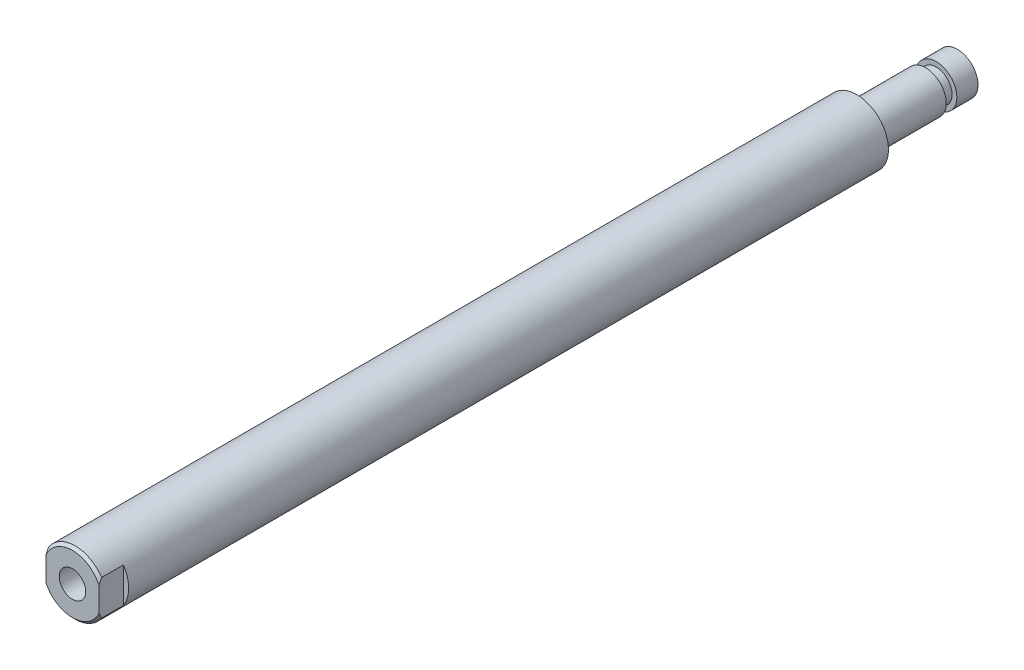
ISO-10303-21;
HEADER;
FILE_DESCRIPTION(('STEP AP214'),'2;1');
FILE_NAME('part.step','',(''),(''),'','','');
FILE_SCHEMA(('AUTOMOTIVE_DESIGN { 1 0 10303 214 1 1 1 1 }'));
ENDSEC;
DATA;
#1=APPLICATION_CONTEXT('core data for automotive mechanical design processes');
#2=APPLICATION_PROTOCOL_DEFINITION('international standard','automotive_design',2000,#1);
#3=PRODUCT_CONTEXT('',#1,'mechanical');
#4=PRODUCT('Part','Part','',(#3));
#5=PRODUCT_RELATED_PRODUCT_CATEGORY('part','',(#4));
#6=PRODUCT_DEFINITION_FORMATION('','',#4);
#7=PRODUCT_DEFINITION_CONTEXT('part definition',#1,'design');
#8=PRODUCT_DEFINITION('design','',#6,#7);
#9=PRODUCT_DEFINITION_SHAPE('','',#8);
#10=(LENGTH_UNIT() NAMED_UNIT(*) SI_UNIT(.MILLI.,.METRE.));
#11=(NAMED_UNIT(*) PLANE_ANGLE_UNIT() SI_UNIT($,.RADIAN.));
#12=(NAMED_UNIT(*) SI_UNIT($,.STERADIAN.) SOLID_ANGLE_UNIT());
#13=UNCERTAINTY_MEASURE_WITH_UNIT(LENGTH_MEASURE(1.E-05),#10,'distance_accuracy_value','');
#14=(GEOMETRIC_REPRESENTATION_CONTEXT(3) GLOBAL_UNCERTAINTY_ASSIGNED_CONTEXT((#13)) GLOBAL_UNIT_ASSIGNED_CONTEXT((#10,
#11,#12)) REPRESENTATION_CONTEXT('',''));
#15=CARTESIAN_POINT('',(0.,0.,0.));
#16=DIRECTION('',(0.,0.,1.));
#17=DIRECTION('',(1.,0.,0.));
#18=AXIS2_PLACEMENT_3D('',#15,#16,#17);
#19=CARTESIAN_POINT('',(0.,3.90000000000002,-167.));
#20=DIRECTION('',(0.,0.,-1.));
#21=DIRECTION('',(-1.,0.,0.));
#22=AXIS2_PLACEMENT_3D('',#19,#20,#21);
#23=PLANE('',#22);
#24=CARTESIAN_POINT('',(0.,0.,-167.));
#25=DIRECTION('',(0.,0.,-1.));
#26=DIRECTION('',(-1.,0.,0.));
#27=AXIS2_PLACEMENT_3D('',#24,#25,#26);
#28=CIRCLE('',#27,3.90000000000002);
#29=CARTESIAN_POINT('',(-3.90000000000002,0.,-167.));
#30=VERTEX_POINT('',#29);
#31=EDGE_CURVE('E141',#30,#30,#28,.T.);
#32=ORIENTED_EDGE('',*,*,#31,.T.);
#33=EDGE_LOOP('',(#32));
#34=FACE_BOUND('',#33,.T.);
#35=ADVANCED_FACE('F33',(#34),#23,.T.);
#36=CARTESIAN_POINT('',(0.,0.,0.));
#37=DIRECTION('',(0.,0.,-1.));
#38=DIRECTION('',(-1.,0.,0.));
#39=AXIS2_PLACEMENT_3D('',#36,#37,#38);
#40=CYLINDRICAL_SURFACE('',#39,3.90000000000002);
#41=CARTESIAN_POINT('',(0.,0.,-163.));
#42=DIRECTION('',(0.,0.,-1.));
#43=DIRECTION('',(-1.,0.,0.));
#44=AXIS2_PLACEMENT_3D('',#41,#42,#43);
#45=CIRCLE('',#44,3.90000000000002);
#46=CARTESIAN_POINT('',(-3.90000000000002,0.,-163.));
#47=VERTEX_POINT('',#46);
#48=EDGE_CURVE('E138',#47,#47,#45,.T.);
#49=ORIENTED_EDGE('',*,*,#48,.T.);
#50=EDGE_LOOP('',(#49));
#51=FACE_BOUND('',#50,.T.);
#52=ORIENTED_EDGE('',*,*,#31,.F.);
#53=EDGE_LOOP('',(#52));
#54=FACE_BOUND('',#53,.T.);
#55=ADVANCED_FACE('F215',(#51,#54),#40,.T.);
#56=CARTESIAN_POINT('',(0.,3.00000000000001,-163.));
#57=DIRECTION('',(0.,0.,1.));
#58=DIRECTION('',(1.,0.,0.));
#59=AXIS2_PLACEMENT_3D('',#56,#57,#58);
#60=PLANE('',#59);
#61=CARTESIAN_POINT('',(0.,0.,-163.));
#62=DIRECTION('',(0.,0.,-1.));
#63=DIRECTION('',(-1.,0.,0.));
#64=AXIS2_PLACEMENT_3D('',#61,#62,#63);
#65=CIRCLE('',#64,3.00000000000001);
#66=CARTESIAN_POINT('',(-3.00000000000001,0.,-163.));
#67=VERTEX_POINT('',#66);
#68=EDGE_CURVE('E135',#67,#67,#65,.T.);
#69=ORIENTED_EDGE('',*,*,#68,.T.);
#70=EDGE_LOOP('',(#69));
#71=FACE_BOUND('',#70,.T.);
#72=ORIENTED_EDGE('',*,*,#48,.F.);
#73=EDGE_LOOP('',(#72));
#74=FACE_BOUND('',#73,.T.);
#75=ADVANCED_FACE('F220',(#71,#74),#60,.T.);
#76=CARTESIAN_POINT('',(0.,0.,0.));
#77=DIRECTION('',(0.,0.,-1.));
#78=DIRECTION('',(-1.,0.,0.));
#79=AXIS2_PLACEMENT_3D('',#76,#77,#78);
#80=CYLINDRICAL_SURFACE('',#79,3.00000000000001);
#81=CARTESIAN_POINT('',(0.,0.,-161.));
#82=DIRECTION('',(0.,0.,-1.));
#83=DIRECTION('',(-1.,0.,0.));
#84=AXIS2_PLACEMENT_3D('',#81,#82,#83);
#85=CIRCLE('',#84,3.00000000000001);
#86=CARTESIAN_POINT('',(-3.00000000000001,0.,-161.));
#87=VERTEX_POINT('',#86);
#88=EDGE_CURVE('E132',#87,#87,#85,.T.);
#89=ORIENTED_EDGE('',*,*,#88,.T.);
#90=EDGE_LOOP('',(#89));
#91=FACE_BOUND('',#90,.T.);
#92=ORIENTED_EDGE('',*,*,#68,.F.);
#93=EDGE_LOOP('',(#92));
#94=FACE_BOUND('',#93,.T.);
#95=ADVANCED_FACE('F227',(#91,#94),#80,.T.);
#96=CARTESIAN_POINT('',(0.,3.00000000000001,-161.));
#97=DIRECTION('',(0.,0.,-1.));
#98=DIRECTION('',(-1.,0.,0.));
#99=AXIS2_PLACEMENT_3D('',#96,#97,#98);
#100=PLANE('',#99);
#101=CARTESIAN_POINT('',(0.,0.,-161.));
#102=DIRECTION('',(0.,0.,-1.));
#103=DIRECTION('',(-1.,0.,0.));
#104=AXIS2_PLACEMENT_3D('',#101,#102,#103);
#105=CIRCLE('',#104,3.90000000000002);
#106=CARTESIAN_POINT('',(-3.90000000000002,0.,-161.));
#107=VERTEX_POINT('',#106);
#108=EDGE_CURVE('E129',#107,#107,#105,.T.);
#109=ORIENTED_EDGE('',*,*,#108,.T.);
#110=EDGE_LOOP('',(#109));
#111=FACE_BOUND('',#110,.T.);
#112=ORIENTED_EDGE('',*,*,#88,.F.);
#113=EDGE_LOOP('',(#112));
#114=FACE_BOUND('',#113,.T.);
#115=ADVANCED_FACE('F233',(#111,#114),#100,.T.);
#116=CARTESIAN_POINT('',(0.,0.,0.));
#117=DIRECTION('',(0.,0.,-1.));
#118=DIRECTION('',(-1.,0.,0.));
#119=AXIS2_PLACEMENT_3D('',#116,#117,#118);
#120=CYLINDRICAL_SURFACE('',#119,3.90000000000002);
#121=CARTESIAN_POINT('',(0.,0.,-149.));
#122=DIRECTION('',(0.,0.,-1.));
#123=DIRECTION('',(-1.,0.,0.));
#124=AXIS2_PLACEMENT_3D('',#121,#122,#123);
#125=CIRCLE('',#124,3.90000000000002);
#126=CARTESIAN_POINT('',(-3.90000000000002,0.,-149.));
#127=VERTEX_POINT('',#126);
#128=EDGE_CURVE('E126',#127,#127,#125,.T.);
#129=ORIENTED_EDGE('',*,*,#128,.T.);
#130=EDGE_LOOP('',(#129));
#131=FACE_BOUND('',#130,.T.);
#132=ORIENTED_EDGE('',*,*,#108,.F.);
#133=EDGE_LOOP('',(#132));
#134=FACE_BOUND('',#133,.T.);
#135=ADVANCED_FACE('F237',(#131,#134),#120,.T.);
#136=CARTESIAN_POINT('',(0.,0.,-148.5));
#137=DIRECTION('',(0.,0.,-1.));
#138=DIRECTION('',(-1.,0.,0.));
#139=AXIS2_PLACEMENT_3D('',#136,#137,#138);
#140=TOROIDAL_SURFACE('',#139,3.90000000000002,0.5);
#141=CARTESIAN_POINT('',(0.,0.,-148.));
#142=DIRECTION('',(0.,0.,-1.));
#143=DIRECTION('',(-1.,0.,0.));
#144=AXIS2_PLACEMENT_3D('',#141,#142,#143);
#145=CIRCLE('',#144,3.90000000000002);
#146=CARTESIAN_POINT('',(-3.90000000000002,0.,-148.));
#147=VERTEX_POINT('',#146);
#148=EDGE_CURVE('E123',#147,#147,#145,.T.);
#149=ORIENTED_EDGE('',*,*,#148,.T.);
#150=EDGE_LOOP('',(#149));
#151=FACE_BOUND('',#150,.T.);
#152=ORIENTED_EDGE('',*,*,#128,.F.);
#153=EDGE_LOOP('',(#152));
#154=FACE_BOUND('',#153,.T.);
#155=ADVANCED_FACE('F241',(#151,#154),#140,.F.);
#156=CARTESIAN_POINT('',(0.,6.,-148.));
#157=DIRECTION('',(0.,0.,-1.));
#158=DIRECTION('',(-1.,0.,0.));
#159=AXIS2_PLACEMENT_3D('',#156,#157,#158);
#160=PLANE('',#159);
#161=CARTESIAN_POINT('',(0.,0.,-148.));
#162=DIRECTION('',(0.,0.,-1.));
#163=DIRECTION('',(-1.,0.,0.));
#164=AXIS2_PLACEMENT_3D('',#161,#162,#163);
#165=CIRCLE('',#164,6.);
#166=CARTESIAN_POINT('',(-6.,0.,-148.));
#167=VERTEX_POINT('',#166);
#168=EDGE_CURVE('E120',#167,#167,#165,.T.);
#169=ORIENTED_EDGE('',*,*,#168,.T.);
#170=EDGE_LOOP('',(#169));
#171=FACE_BOUND('',#170,.T.);
#172=ORIENTED_EDGE('',*,*,#148,.F.);
#173=EDGE_LOOP('',(#172));
#174=FACE_BOUND('',#173,.T.);
#175=ADVANCED_FACE('F245',(#171,#174),#160,.T.);
#176=CARTESIAN_POINT('',(0.,0.,0.));
#177=DIRECTION('',(0.,0.,-1.));
#178=DIRECTION('',(-1.,0.,0.));
#179=AXIS2_PLACEMENT_3D('',#176,#177,#178);
#180=CYLINDRICAL_SURFACE('',#179,6.);
#181=DIRECTION('',(0.,0.,-1.));
#182=VECTOR('',#181,1.);
#183=CARTESIAN_POINT('',(5.,-3.3166247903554,0.));
#184=LINE('',#183,#182);
#185=CARTESIAN_POINT('',(5.,-3.3166247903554,-0.500000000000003));
#186=VERTEX_POINT('',#185);
#187=CARTESIAN_POINT('',(5.,-3.3166247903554,-4.6));
#188=VERTEX_POINT('',#187);
#189=EDGE_CURVE('E116',#186,#188,#184,.T.);
#190=ORIENTED_EDGE('',*,*,#189,.F.);
#191=CARTESIAN_POINT('',(0.,0.,-0.500000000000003));
#192=DIRECTION('',(0.,0.,1.));
#193=DIRECTION('',(1.,0.,0.));
#194=AXIS2_PLACEMENT_3D('',#191,#192,#193);
#195=CIRCLE('',#194,6.);
#196=CARTESIAN_POINT('',(-5.,-3.3166247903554,-0.500000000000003));
#197=VERTEX_POINT('',#196);
#198=EDGE_CURVE('E156',#186,#197,#195,.F.);
#199=ORIENTED_EDGE('',*,*,#198,.T.);
#200=DIRECTION('',(0.,0.,-1.));
#201=VECTOR('',#200,1.);
#202=CARTESIAN_POINT('',(-5.,-3.3166247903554,0.));
#203=LINE('',#202,#201);
#204=CARTESIAN_POINT('',(-5.,-3.3166247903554,-4.6));
#205=VERTEX_POINT('',#204);
#206=EDGE_CURVE('E110',#205,#197,#203,.F.);
#207=ORIENTED_EDGE('',*,*,#206,.F.);
#208=CARTESIAN_POINT('',(0.,0.,-4.6));
#209=DIRECTION('',(0.,0.,-1.));
#210=DIRECTION('',(-1.,0.,0.));
#211=AXIS2_PLACEMENT_3D('',#208,#209,#210);
#212=CIRCLE('',#211,6.);
#213=CARTESIAN_POINT('',(-5.,3.3166247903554,-4.6));
#214=VERTEX_POINT('',#213);
#215=EDGE_CURVE('E151',#214,#205,#212,.F.);
#216=ORIENTED_EDGE('',*,*,#215,.F.);
#217=DIRECTION('',(0.,0.,-1.));
#218=VECTOR('',#217,1.);
#219=CARTESIAN_POINT('',(-5.,3.3166247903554,0.));
#220=LINE('',#219,#218);
#221=CARTESIAN_POINT('',(-5.,3.3166247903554,-0.500000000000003));
#222=VERTEX_POINT('',#221);
#223=EDGE_CURVE('E108',#222,#214,#220,.T.);
#224=ORIENTED_EDGE('',*,*,#223,.F.);
#225=CARTESIAN_POINT('',(0.,0.,-0.500000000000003));
#226=DIRECTION('',(0.,0.,1.));
#227=DIRECTION('',(1.,0.,0.));
#228=AXIS2_PLACEMENT_3D('',#225,#226,#227);
#229=CIRCLE('',#228,6.);
#230=CARTESIAN_POINT('',(5.,3.3166247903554,-0.500000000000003));
#231=VERTEX_POINT('',#230);
#232=EDGE_CURVE('E153',#222,#231,#229,.F.);
#233=ORIENTED_EDGE('',*,*,#232,.T.);
#234=DIRECTION('',(0.,0.,-1.));
#235=VECTOR('',#234,1.);
#236=CARTESIAN_POINT('',(5.,3.3166247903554,0.));
#237=LINE('',#236,#235);
#238=CARTESIAN_POINT('',(5.,3.3166247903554,-4.6));
#239=VERTEX_POINT('',#238);
#240=EDGE_CURVE('E118',#239,#231,#237,.F.);
#241=ORIENTED_EDGE('',*,*,#240,.F.);
#242=CARTESIAN_POINT('',(0.,0.,-4.6));
#243=DIRECTION('',(0.,0.,-1.));
#244=DIRECTION('',(-1.,0.,0.));
#245=AXIS2_PLACEMENT_3D('',#242,#243,#244);
#246=CIRCLE('',#245,6.);
#247=EDGE_CURVE('E146',#188,#239,#246,.F.);
#248=ORIENTED_EDGE('',*,*,#247,.F.);
#249=EDGE_LOOP('',(#190,#199,#207,#216,#224,#233,#241,#248));
#250=FACE_BOUND('',#249,.T.);
#251=ORIENTED_EDGE('',*,*,#168,.F.);
#252=EDGE_LOOP('',(#251));
#253=FACE_BOUND('',#252,.T.);
#254=ADVANCED_FACE('F204',(#250,#253),#180,.T.);
#255=CARTESIAN_POINT('',(0.,0.,0.));
#256=DIRECTION('',(0.,0.,1.));
#257=DIRECTION('',(1.,0.,0.));
#258=AXIS2_PLACEMENT_3D('',#255,#256,#257);
#259=PLANE('',#258);
#260=CARTESIAN_POINT('',(0.,0.,0.));
#261=DIRECTION('',(0.,0.,1.));
#262=DIRECTION('',(1.,0.,0.));
#263=AXIS2_PLACEMENT_3D('',#260,#261,#262);
#264=CIRCLE('',#263,2.49999999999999);
#265=CARTESIAN_POINT('',(2.49999999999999,0.,0.));
#266=VERTEX_POINT('',#265);
#267=EDGE_CURVE('E100',#266,#266,#264,.T.);
#268=ORIENTED_EDGE('',*,*,#267,.F.);
#269=EDGE_LOOP('',(#268));
#270=FACE_BOUND('',#269,.T.);
#271=DIRECTION('',(0.,1.,0.));
#272=VECTOR('',#271,1.);
#273=CARTESIAN_POINT('',(-5.,0.,0.));
#274=LINE('',#273,#272);
#275=CARTESIAN_POINT('',(-5.,-2.2912878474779,0.));
#276=VERTEX_POINT('',#275);
#277=CARTESIAN_POINT('',(-5.,2.2912878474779,0.));
#278=VERTEX_POINT('',#277);
#279=EDGE_CURVE('E148',#276,#278,#274,.T.);
#280=ORIENTED_EDGE('',*,*,#279,.F.);
#281=CARTESIAN_POINT('',(0.,0.,0.));
#282=DIRECTION('',(0.,0.,1.));
#283=DIRECTION('',(1.,0.,0.));
#284=AXIS2_PLACEMENT_3D('',#281,#282,#283);
#285=CIRCLE('',#284,5.49999999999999);
#286=CARTESIAN_POINT('',(5.,-2.2912878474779,0.));
#287=VERTEX_POINT('',#286);
#288=EDGE_CURVE('E52',#276,#287,#285,.T.);
#289=ORIENTED_EDGE('',*,*,#288,.T.);
#290=DIRECTION('',(0.,-1.,0.));
#291=VECTOR('',#290,1.);
#292=CARTESIAN_POINT('',(5.,0.,0.));
#293=LINE('',#292,#291);
#294=CARTESIAN_POINT('',(5.,2.2912878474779,0.));
#295=VERTEX_POINT('',#294);
#296=EDGE_CURVE('E144',#295,#287,#293,.T.);
#297=ORIENTED_EDGE('',*,*,#296,.F.);
#298=CARTESIAN_POINT('',(0.,0.,0.));
#299=DIRECTION('',(0.,0.,1.));
#300=DIRECTION('',(1.,0.,0.));
#301=AXIS2_PLACEMENT_3D('',#298,#299,#300);
#302=CIRCLE('',#301,5.49999999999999);
#303=EDGE_CURVE('E193',#295,#278,#302,.T.);
#304=ORIENTED_EDGE('',*,*,#303,.T.);
#305=EDGE_LOOP('',(#280,#289,#297,#304));
#306=FACE_BOUND('',#305,.T.);
#307=ADVANCED_FACE('F186',(#270,#306),#259,.T.);
#308=CARTESIAN_POINT('',(5.,-6.,0.));
#309=DIRECTION('',(-1.,0.,0.));
#310=DIRECTION('',(0.,0.,1.));
#311=AXIS2_PLACEMENT_3D('',#308,#309,#310);
#312=PLANE('',#311);
#313=ORIENTED_EDGE('',*,*,#296,.T.);
#314=CARTESIAN_POINT('',(5.,-2.2912878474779,0.));
#315=CARTESIAN_POINT('',(5.,-2.37912643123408,-0.0365976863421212));
#316=CARTESIAN_POINT('',(5.,-2.4663415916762,-0.074666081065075));
#317=CARTESIAN_POINT('',(5.,-2.6395087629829,-0.153410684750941));
#318=CARTESIAN_POINT('',(5.,-2.72546167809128,-0.194084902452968));
#319=CARTESIAN_POINT('',(5.,-2.8962115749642,-0.277759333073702));
#320=CARTESIAN_POINT('',(5.,-2.98100867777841,-0.320759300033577));
#321=CARTESIAN_POINT('',(5.,-3.1495829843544,-0.408867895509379));
#322=CARTESIAN_POINT('',(5.,-3.23335936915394,-0.453978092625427));
#323=CARTESIAN_POINT('',(5.,-3.3166247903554,-0.500000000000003));
#324=B_SPLINE_CURVE_WITH_KNOTS('',3,(#314,#315,#316,#317,#318,#319,#320,#321,#322,#323),
.UNSPECIFIED.,.F.,.F.,(4,2,2,2,4),(0.,0.285445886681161,0.5706761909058,0.85587638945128,
1.14129206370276),.UNSPECIFIED.);
#325=EDGE_CURVE('E11',#287,#186,#324,.T.);
#326=ORIENTED_EDGE('',*,*,#325,.T.);
#327=ORIENTED_EDGE('',*,*,#189,.T.);
#328=DIRECTION('',(0.,1.,0.));
#329=VECTOR('',#328,1.);
#330=CARTESIAN_POINT('',(5.,-6.,-4.6));
#331=LINE('',#330,#329);
#332=EDGE_CURVE('E113',#188,#239,#331,.T.);
#333=ORIENTED_EDGE('',*,*,#332,.T.);
#334=ORIENTED_EDGE('',*,*,#240,.T.);
#335=CARTESIAN_POINT('',(5.,3.3166247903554,-0.500000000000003));
#336=CARTESIAN_POINT('',(5.,3.23335936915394,-0.453978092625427));
#337=CARTESIAN_POINT('',(5.,3.1495829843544,-0.408867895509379));
#338=CARTESIAN_POINT('',(5.,2.98100867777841,-0.320759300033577));
#339=CARTESIAN_POINT('',(5.,2.8962115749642,-0.277759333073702));
#340=CARTESIAN_POINT('',(5.,2.72546167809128,-0.194084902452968));
#341=CARTESIAN_POINT('',(5.,2.6395087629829,-0.153410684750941));
#342=CARTESIAN_POINT('',(5.,2.4663415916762,-0.0746660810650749));
#343=CARTESIAN_POINT('',(5.,2.37912643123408,-0.0365976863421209));
#344=CARTESIAN_POINT('',(5.,2.2912878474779,0.));
#345=B_SPLINE_CURVE_WITH_KNOTS('',3,(#335,#336,#337,#338,#339,#340,#341,#342,#343,#344),
.UNSPECIFIED.,.F.,.F.,(4,2,2,2,4),(0.,0.285415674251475,0.570615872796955,0.855846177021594,
1.14129206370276),.UNSPECIFIED.);
#346=EDGE_CURVE('E45',#231,#295,#345,.T.);
#347=ORIENTED_EDGE('',*,*,#346,.T.);
#348=EDGE_LOOP('',(#313,#326,#327,#333,#334,#347));
#349=FACE_BOUND('',#348,.T.);
#350=ADVANCED_FACE('F180',(#349),#312,.F.);
#351=CARTESIAN_POINT('',(6.,-6.,-4.6));
#352=DIRECTION('',(0.,0.,-1.));
#353=DIRECTION('',(-1.,0.,0.));
#354=AXIS2_PLACEMENT_3D('',#351,#352,#353);
#355=PLANE('',#354);
#356=ORIENTED_EDGE('',*,*,#332,.F.);
#357=ORIENTED_EDGE('',*,*,#247,.T.);
#358=EDGE_LOOP('',(#356,#357));
#359=FACE_BOUND('',#358,.T.);
#360=ADVANCED_FACE('F185',(#359),#355,.F.);
#361=CARTESIAN_POINT('',(-6.,-6.,-4.6));
#362=DIRECTION('',(0.,0.,-1.));
#363=DIRECTION('',(-1.,0.,0.));
#364=AXIS2_PLACEMENT_3D('',#361,#362,#363);
#365=PLANE('',#364);
#366=ORIENTED_EDGE('',*,*,#215,.T.);
#367=DIRECTION('',(0.,1.,0.));
#368=VECTOR('',#367,1.);
#369=CARTESIAN_POINT('',(-5.,-6.,-4.6));
#370=LINE('',#369,#368);
#371=EDGE_CURVE('E103',#205,#214,#370,.T.);
#372=ORIENTED_EDGE('',*,*,#371,.T.);
#373=EDGE_LOOP('',(#366,#372));
#374=FACE_BOUND('',#373,.T.);
#375=ADVANCED_FACE('F177',(#374),#365,.F.);
#376=CARTESIAN_POINT('',(-5.,-6.,0.));
#377=DIRECTION('',(1.,0.,0.));
#378=DIRECTION('',(0.,0.,-1.));
#379=AXIS2_PLACEMENT_3D('',#376,#377,#378);
#380=PLANE('',#379);
#381=ORIENTED_EDGE('',*,*,#206,.T.);
#382=CARTESIAN_POINT('',(-5.,-3.3166247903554,-0.500000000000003));
#383=CARTESIAN_POINT('',(-5.,-3.23335936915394,-0.453978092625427));
#384=CARTESIAN_POINT('',(-5.,-3.1495829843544,-0.40886789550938));
#385=CARTESIAN_POINT('',(-5.,-2.98100867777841,-0.320759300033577));
#386=CARTESIAN_POINT('',(-5.,-2.8962115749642,-0.277759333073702));
#387=CARTESIAN_POINT('',(-5.,-2.72546167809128,-0.194084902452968));
#388=CARTESIAN_POINT('',(-5.,-2.6395087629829,-0.153410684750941));
#389=CARTESIAN_POINT('',(-5.,-2.4663415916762,-0.074666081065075));
#390=CARTESIAN_POINT('',(-5.,-2.37912643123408,-0.036597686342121));
#391=CARTESIAN_POINT('',(-5.,-2.2912878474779,0.));
#392=B_SPLINE_CURVE_WITH_KNOTS('',3,(#382,#383,#384,#385,#386,#387,#388,#389,#390,#391),
.UNSPECIFIED.,.F.,.F.,(4,2,2,2,4),(0.,0.285415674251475,0.570615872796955,0.855846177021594,
1.14129206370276),.UNSPECIFIED.);
#393=EDGE_CURVE('E166',#197,#276,#392,.T.);
#394=ORIENTED_EDGE('',*,*,#393,.T.);
#395=ORIENTED_EDGE('',*,*,#279,.T.);
#396=CARTESIAN_POINT('',(-5.,2.2912878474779,0.));
#397=CARTESIAN_POINT('',(-5.,2.37912643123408,-0.0365976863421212));
#398=CARTESIAN_POINT('',(-5.,2.4663415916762,-0.074666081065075));
#399=CARTESIAN_POINT('',(-5.,2.6395087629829,-0.153410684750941));
#400=CARTESIAN_POINT('',(-5.,2.72546167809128,-0.194084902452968));
#401=CARTESIAN_POINT('',(-5.,2.8962115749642,-0.277759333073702));
#402=CARTESIAN_POINT('',(-5.,2.98100867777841,-0.320759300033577));
#403=CARTESIAN_POINT('',(-5.,3.1495829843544,-0.408867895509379));
#404=CARTESIAN_POINT('',(-5.,3.23335936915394,-0.453978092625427));
#405=CARTESIAN_POINT('',(-5.,3.3166247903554,-0.500000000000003));
#406=B_SPLINE_CURVE_WITH_KNOTS('',3,(#396,#397,#398,#399,#400,#401,#402,#403,#404,#405),
.UNSPECIFIED.,.F.,.F.,(4,2,2,2,4),(0.,0.285445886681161,0.570676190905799,0.855876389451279,
1.14129206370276),.UNSPECIFIED.);
#407=EDGE_CURVE('E159',#278,#222,#406,.T.);
#408=ORIENTED_EDGE('',*,*,#407,.T.);
#409=ORIENTED_EDGE('',*,*,#223,.T.);
#410=ORIENTED_EDGE('',*,*,#371,.F.);
#411=EDGE_LOOP('',(#381,#394,#395,#408,#409,#410));
#412=FACE_BOUND('',#411,.T.);
#413=ADVANCED_FACE('F173',(#412),#380,.F.);
#414=CARTESIAN_POINT('',(0.,0.,0.));
#415=DIRECTION('',(0.,0.,1.));
#416=DIRECTION('',(1.,0.,0.));
#417=AXIS2_PLACEMENT_3D('',#414,#415,#416);
#418=CYLINDRICAL_SURFACE('',#417,2.49999999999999);
#419=CARTESIAN_POINT('',(0.,0.,-23.));
#420=DIRECTION('',(0.,0.,1.));
#421=DIRECTION('',(1.,0.,0.));
#422=AXIS2_PLACEMENT_3D('',#419,#420,#421);
#423=CIRCLE('',#422,2.49999999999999);
#424=CARTESIAN_POINT('',(2.49999999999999,0.,-23.));
#425=VERTEX_POINT('',#424);
#426=EDGE_CURVE('E98',#425,#425,#423,.T.);
#427=ORIENTED_EDGE('',*,*,#426,.F.);
#428=EDGE_LOOP('',(#427));
#429=FACE_BOUND('',#428,.T.);
#430=ORIENTED_EDGE('',*,*,#267,.T.);
#431=EDGE_LOOP('',(#430));
#432=FACE_BOUND('',#431,.T.);
#433=ADVANCED_FACE('F94',(#429,#432),#418,.F.);
#434=CARTESIAN_POINT('',(0.,0.,-23.));
#435=DIRECTION('',(0.,0.,1.));
#436=DIRECTION('',(1.,0.,0.));
#437=AXIS2_PLACEMENT_3D('',#434,#435,#436);
#438=CONICAL_SURFACE('',#437,2.49999999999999,1.02974425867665);
#439=CARTESIAN_POINT('',(0.,0.,-24.5021515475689));
#440=VERTEX_POINT('',#439);
#441=VERTEX_LOOP('',#440);
#442=FACE_BOUND('',#441,.T.);
#443=ORIENTED_EDGE('',*,*,#426,.T.);
#444=EDGE_LOOP('',(#443));
#445=FACE_BOUND('',#444,.T.);
#446=ADVANCED_FACE('F90',(#442,#445),#438,.F.);
#447=CARTESIAN_POINT('',(0.,0.,-0.500000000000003));
#448=DIRECTION('',(0.,0.,-1.));
#449=DIRECTION('',(-1.,0.,0.));
#450=AXIS2_PLACEMENT_3D('',#447,#448,#449);
#451=CONICAL_SURFACE('',#450,6.,0.785398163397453);
#452=ORIENTED_EDGE('',*,*,#325,.F.);
#453=ORIENTED_EDGE('',*,*,#288,.F.);
#454=ORIENTED_EDGE('',*,*,#393,.F.);
#455=ORIENTED_EDGE('',*,*,#198,.F.);
#456=EDGE_LOOP('',(#452,#453,#454,#455));
#457=FACE_BOUND('',#456,.T.);
#458=ADVANCED_FACE('F93',(#457),#451,.T.);
#459=CARTESIAN_POINT('',(0.,0.,-0.500000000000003));
#460=DIRECTION('',(0.,0.,-1.));
#461=DIRECTION('',(-1.,0.,0.));
#462=AXIS2_PLACEMENT_3D('',#459,#460,#461);
#463=CONICAL_SURFACE('',#462,6.,0.785398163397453);
#464=ORIENTED_EDGE('',*,*,#407,.F.);
#465=ORIENTED_EDGE('',*,*,#303,.F.);
#466=ORIENTED_EDGE('',*,*,#346,.F.);
#467=ORIENTED_EDGE('',*,*,#232,.F.);
#468=EDGE_LOOP('',(#464,#465,#466,#467));
#469=FACE_BOUND('',#468,.T.);
#470=ADVANCED_FACE('F171',(#469),#463,.T.);
#471=CLOSED_SHELL('',(#35,#55,#75,#95,#115,#135,#155,#175,#254,#307,#350,#360,#375,#413,#433,
#446,#458,#470));
#472=MANIFOLD_SOLID_BREP('B2',#471);
#473=ADVANCED_BREP_SHAPE_REPRESENTATION('',(#18,#472),#14);
#474=SHAPE_DEFINITION_REPRESENTATION(#9,#473);
ENDSEC;
END-ISO-10303-21;
